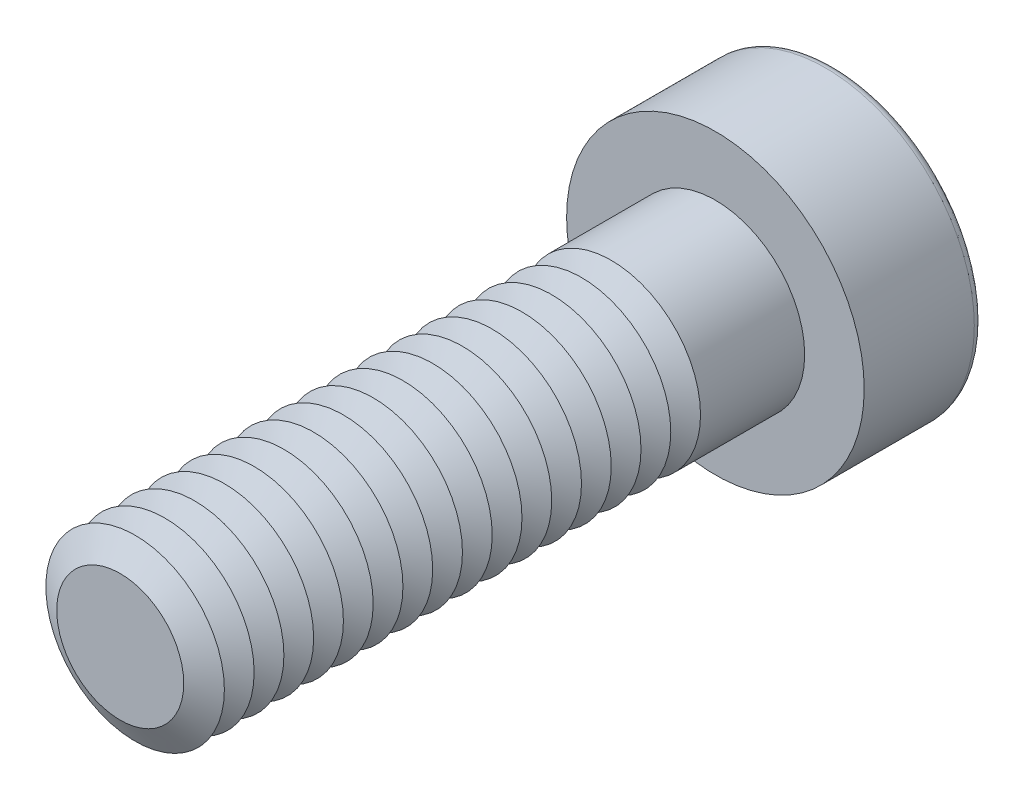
ISO-10303-21;
HEADER;
FILE_DESCRIPTION(('STEP AP214'),'2;1');
FILE_NAME('part.step','',(''),(''),'','','');
FILE_SCHEMA(('AUTOMOTIVE_DESIGN { 1 0 10303 214 1 1 1 1 }'));
ENDSEC;
DATA;
#1=APPLICATION_CONTEXT('core data for automotive mechanical design processes');
#2=APPLICATION_PROTOCOL_DEFINITION('international standard','automotive_design',2000,#1);
#3=PRODUCT_CONTEXT('',#1,'mechanical');
#4=PRODUCT('Part','Part','',(#3));
#5=PRODUCT_RELATED_PRODUCT_CATEGORY('part','',(#4));
#6=PRODUCT_DEFINITION_FORMATION('','',#4);
#7=PRODUCT_DEFINITION_CONTEXT('part definition',#1,'design');
#8=PRODUCT_DEFINITION('design','',#6,#7);
#9=PRODUCT_DEFINITION_SHAPE('','',#8);
#10=(LENGTH_UNIT() NAMED_UNIT(*) SI_UNIT(.MILLI.,.METRE.));
#11=(NAMED_UNIT(*) PLANE_ANGLE_UNIT() SI_UNIT($,.RADIAN.));
#12=(NAMED_UNIT(*) SI_UNIT($,.STERADIAN.) SOLID_ANGLE_UNIT());
#13=UNCERTAINTY_MEASURE_WITH_UNIT(LENGTH_MEASURE(1.E-05),#10,'distance_accuracy_value','');
#14=(GEOMETRIC_REPRESENTATION_CONTEXT(3) GLOBAL_UNCERTAINTY_ASSIGNED_CONTEXT((#13)) GLOBAL_UNIT_ASSIGNED_CONTEXT((#10,
#11,#12)) REPRESENTATION_CONTEXT('',''));
#15=CARTESIAN_POINT('',(0.,0.,0.));
#16=DIRECTION('',(0.,0.,1.));
#17=DIRECTION('',(1.,0.,0.));
#18=AXIS2_PLACEMENT_3D('',#15,#16,#17);
#19=CARTESIAN_POINT('',(0.,0.,16.5));
#20=DIRECTION('',(0.,0.,1.));
#21=DIRECTION('',(1.,0.,0.));
#22=AXIS2_PLACEMENT_3D('',#19,#20,#21);
#23=CONICAL_SURFACE('',#22,3.,1.0471975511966);
#24=CARTESIAN_POINT('',(0.,0.,16.));
#25=DIRECTION('',(0.,0.,1.));
#26=DIRECTION('',(1.,0.,0.));
#27=AXIS2_PLACEMENT_3D('',#24,#25,#26);
#28=CIRCLE('',#27,2.13397459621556);
#29=CARTESIAN_POINT('',(2.13397459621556,0.,16.));
#30=VERTEX_POINT('',#29);
#31=EDGE_CURVE('E313',#30,#30,#28,.T.);
#32=ORIENTED_EDGE('',*,*,#31,.T.);
#33=EDGE_LOOP('',(#32));
#34=FACE_BOUND('',#33,.T.);
#35=CARTESIAN_POINT('',(0.,0.,16.5));
#36=DIRECTION('',(0.,0.,1.));
#37=DIRECTION('',(1.,0.,0.));
#38=AXIS2_PLACEMENT_3D('',#35,#36,#37);
#39=CIRCLE('',#38,3.);
#40=CARTESIAN_POINT('',(3.,0.,16.5));
#41=VERTEX_POINT('',#40);
#42=EDGE_CURVE('E316',#41,#41,#39,.T.);
#43=ORIENTED_EDGE('',*,*,#42,.F.);
#44=EDGE_LOOP('',(#43));
#45=FACE_BOUND('',#44,.T.);
#46=ADVANCED_FACE('F39',(#34,#45),#23,.T.);
#47=CARTESIAN_POINT('',(0.,0.,16.));
#48=DIRECTION('',(0.,0.,-1.));
#49=DIRECTION('',(-1.,0.,0.));
#50=AXIS2_PLACEMENT_3D('',#47,#48,#49);
#51=CONICAL_SURFACE('',#50,2.13397459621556,1.0471975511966);
#52=CARTESIAN_POINT('',(0.,0.,15.5));
#53=DIRECTION('',(0.,0.,1.));
#54=DIRECTION('',(1.,0.,0.));
#55=AXIS2_PLACEMENT_3D('',#52,#53,#54);
#56=CIRCLE('',#55,3.);
#57=CARTESIAN_POINT('',(3.,0.,15.5));
#58=VERTEX_POINT('',#57);
#59=EDGE_CURVE('E323',#58,#58,#56,.T.);
#60=ORIENTED_EDGE('',*,*,#59,.T.);
#61=EDGE_LOOP('',(#60));
#62=FACE_BOUND('',#61,.T.);
#63=ORIENTED_EDGE('',*,*,#31,.F.);
#64=EDGE_LOOP('',(#63));
#65=FACE_BOUND('',#64,.T.);
#66=ADVANCED_FACE('F244',(#62,#65),#51,.T.);
#67=CARTESIAN_POINT('',(0.,0.,20.));
#68=DIRECTION('',(0.,0.,1.));
#69=DIRECTION('',(1.,0.,0.));
#70=AXIS2_PLACEMENT_3D('',#67,#68,#69);
#71=PLANE('',#70);
#72=CARTESIAN_POINT('',(0.,0.,20.));
#73=DIRECTION('',(0.,0.,1.));
#74=DIRECTION('',(1.,0.,0.));
#75=AXIS2_PLACEMENT_3D('',#72,#73,#74);
#76=CIRCLE('',#75,2.13397459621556);
#77=CARTESIAN_POINT('',(2.13397459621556,0.,20.));
#78=VERTEX_POINT('',#77);
#79=EDGE_CURVE('E173',#78,#78,#76,.T.);
#80=ORIENTED_EDGE('',*,*,#79,.T.);
#81=EDGE_LOOP('',(#80));
#82=FACE_BOUND('',#81,.T.);
#83=ADVANCED_FACE('F250',(#82),#71,.T.);
#84=CARTESIAN_POINT('',(0.,0.,20.));
#85=DIRECTION('',(0.,0.,-1.));
#86=DIRECTION('',(-1.,0.,0.));
#87=AXIS2_PLACEMENT_3D('',#84,#85,#86);
#88=CONICAL_SURFACE('',#87,2.13397459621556,1.0471975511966);
#89=CARTESIAN_POINT('',(0.,0.,19.5));
#90=DIRECTION('',(0.,0.,1.));
#91=DIRECTION('',(1.,0.,0.));
#92=AXIS2_PLACEMENT_3D('',#89,#90,#91);
#93=CIRCLE('',#92,3.);
#94=CARTESIAN_POINT('',(3.,0.,19.5));
#95=VERTEX_POINT('',#94);
#96=EDGE_CURVE('E290',#95,#95,#93,.T.);
#97=ORIENTED_EDGE('',*,*,#96,.T.);
#98=EDGE_LOOP('',(#97));
#99=FACE_BOUND('',#98,.T.);
#100=ORIENTED_EDGE('',*,*,#79,.F.);
#101=EDGE_LOOP('',(#100));
#102=FACE_BOUND('',#101,.T.);
#103=ADVANCED_FACE('F198',(#99,#102),#88,.T.);
#104=CARTESIAN_POINT('',(0.,0.,19.5));
#105=DIRECTION('',(0.,0.,1.));
#106=DIRECTION('',(1.,0.,0.));
#107=AXIS2_PLACEMENT_3D('',#104,#105,#106);
#108=CONICAL_SURFACE('',#107,3.,1.0471975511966);
#109=CARTESIAN_POINT('',(0.,0.,19.));
#110=DIRECTION('',(0.,0.,1.));
#111=DIRECTION('',(1.,0.,0.));
#112=AXIS2_PLACEMENT_3D('',#109,#110,#111);
#113=CIRCLE('',#112,2.13397459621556);
#114=CARTESIAN_POINT('',(2.13397459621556,0.,19.));
#115=VERTEX_POINT('',#114);
#116=EDGE_CURVE('E287',#115,#115,#113,.T.);
#117=ORIENTED_EDGE('',*,*,#116,.T.);
#118=EDGE_LOOP('',(#117));
#119=FACE_BOUND('',#118,.T.);
#120=ORIENTED_EDGE('',*,*,#96,.F.);
#121=EDGE_LOOP('',(#120));
#122=FACE_BOUND('',#121,.T.);
#123=ADVANCED_FACE('F276',(#119,#122),#108,.T.);
#124=CARTESIAN_POINT('',(0.,0.,19.));
#125=DIRECTION('',(0.,0.,-1.));
#126=DIRECTION('',(-1.,0.,0.));
#127=AXIS2_PLACEMENT_3D('',#124,#125,#126);
#128=CONICAL_SURFACE('',#127,2.13397459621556,1.0471975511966);
#129=CARTESIAN_POINT('',(0.,0.,18.5));
#130=DIRECTION('',(0.,0.,1.));
#131=DIRECTION('',(1.,0.,0.));
#132=AXIS2_PLACEMENT_3D('',#129,#130,#131);
#133=CIRCLE('',#132,3.);
#134=CARTESIAN_POINT('',(3.,0.,18.5));
#135=VERTEX_POINT('',#134);
#136=EDGE_CURVE('E299',#135,#135,#133,.T.);
#137=ORIENTED_EDGE('',*,*,#136,.T.);
#138=EDGE_LOOP('',(#137));
#139=FACE_BOUND('',#138,.T.);
#140=ORIENTED_EDGE('',*,*,#116,.F.);
#141=EDGE_LOOP('',(#140));
#142=FACE_BOUND('',#141,.T.);
#143=ADVANCED_FACE('F273',(#139,#142),#128,.T.);
#144=CARTESIAN_POINT('',(0.,0.,18.5));
#145=DIRECTION('',(0.,0.,1.));
#146=DIRECTION('',(1.,0.,0.));
#147=AXIS2_PLACEMENT_3D('',#144,#145,#146);
#148=CONICAL_SURFACE('',#147,3.,1.0471975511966);
#149=CARTESIAN_POINT('',(0.,0.,18.));
#150=DIRECTION('',(0.,0.,1.));
#151=DIRECTION('',(1.,0.,0.));
#152=AXIS2_PLACEMENT_3D('',#149,#150,#151);
#153=CIRCLE('',#152,2.13397459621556);
#154=CARTESIAN_POINT('',(2.13397459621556,0.,18.));
#155=VERTEX_POINT('',#154);
#156=EDGE_CURVE('E292',#155,#155,#153,.T.);
#157=ORIENTED_EDGE('',*,*,#156,.T.);
#158=EDGE_LOOP('',(#157));
#159=FACE_BOUND('',#158,.T.);
#160=ORIENTED_EDGE('',*,*,#136,.F.);
#161=EDGE_LOOP('',(#160));
#162=FACE_BOUND('',#161,.T.);
#163=ADVANCED_FACE('F269',(#159,#162),#148,.T.);
#164=CARTESIAN_POINT('',(0.,0.,18.));
#165=DIRECTION('',(0.,0.,-1.));
#166=DIRECTION('',(-1.,0.,0.));
#167=AXIS2_PLACEMENT_3D('',#164,#165,#166);
#168=CONICAL_SURFACE('',#167,2.13397459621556,1.0471975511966);
#169=CARTESIAN_POINT('',(0.,0.,17.5));
#170=DIRECTION('',(0.,0.,1.));
#171=DIRECTION('',(1.,0.,0.));
#172=AXIS2_PLACEMENT_3D('',#169,#170,#171);
#173=CIRCLE('',#172,3.);
#174=CARTESIAN_POINT('',(3.,0.,17.5));
#175=VERTEX_POINT('',#174);
#176=EDGE_CURVE('E309',#175,#175,#173,.T.);
#177=ORIENTED_EDGE('',*,*,#176,.T.);
#178=EDGE_LOOP('',(#177));
#179=FACE_BOUND('',#178,.T.);
#180=ORIENTED_EDGE('',*,*,#156,.F.);
#181=EDGE_LOOP('',(#180));
#182=FACE_BOUND('',#181,.T.);
#183=ADVANCED_FACE('F265',(#179,#182),#168,.T.);
#184=CARTESIAN_POINT('',(0.,0.,17.5));
#185=DIRECTION('',(0.,0.,1.));
#186=DIRECTION('',(1.,0.,0.));
#187=AXIS2_PLACEMENT_3D('',#184,#185,#186);
#188=CONICAL_SURFACE('',#187,3.,1.0471975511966);
#189=CARTESIAN_POINT('',(0.,0.,17.));
#190=DIRECTION('',(0.,0.,1.));
#191=DIRECTION('',(1.,0.,0.));
#192=AXIS2_PLACEMENT_3D('',#189,#190,#191);
#193=CIRCLE('',#192,2.13397459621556);
#194=CARTESIAN_POINT('',(2.13397459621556,0.,17.));
#195=VERTEX_POINT('',#194);
#196=EDGE_CURVE('E305',#195,#195,#193,.T.);
#197=ORIENTED_EDGE('',*,*,#196,.T.);
#198=EDGE_LOOP('',(#197));
#199=FACE_BOUND('',#198,.T.);
#200=ORIENTED_EDGE('',*,*,#176,.F.);
#201=EDGE_LOOP('',(#200));
#202=FACE_BOUND('',#201,.T.);
#203=ADVANCED_FACE('F261',(#199,#202),#188,.T.);
#204=CARTESIAN_POINT('',(0.,0.,17.));
#205=DIRECTION('',(0.,0.,-1.));
#206=DIRECTION('',(-1.,0.,0.));
#207=AXIS2_PLACEMENT_3D('',#204,#205,#206);
#208=CONICAL_SURFACE('',#207,2.13397459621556,1.0471975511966);
#209=ORIENTED_EDGE('',*,*,#42,.T.);
#210=EDGE_LOOP('',(#209));
#211=FACE_BOUND('',#210,.T.);
#212=ORIENTED_EDGE('',*,*,#196,.F.);
#213=EDGE_LOOP('',(#212));
#214=FACE_BOUND('',#213,.T.);
#215=ADVANCED_FACE('F257',(#211,#214),#208,.T.);
#216=CARTESIAN_POINT('',(0.,0.,15.5));
#217=DIRECTION('',(0.,0.,1.));
#218=DIRECTION('',(1.,0.,0.));
#219=AXIS2_PLACEMENT_3D('',#216,#217,#218);
#220=CONICAL_SURFACE('',#219,3.,1.0471975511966);
#221=CARTESIAN_POINT('',(0.,0.,15.));
#222=DIRECTION('',(0.,0.,1.));
#223=DIRECTION('',(1.,0.,0.));
#224=AXIS2_PLACEMENT_3D('',#221,#222,#223);
#225=CIRCLE('',#224,2.13397459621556);
#226=CARTESIAN_POINT('',(2.13397459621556,0.,15.));
#227=VERTEX_POINT('',#226);
#228=EDGE_CURVE('E319',#227,#227,#225,.T.);
#229=ORIENTED_EDGE('',*,*,#228,.T.);
#230=EDGE_LOOP('',(#229));
#231=FACE_BOUND('',#230,.T.);
#232=ORIENTED_EDGE('',*,*,#59,.F.);
#233=EDGE_LOOP('',(#232));
#234=FACE_BOUND('',#233,.T.);
#235=ADVANCED_FACE('F260',(#231,#234),#220,.T.);
#236=CARTESIAN_POINT('',(0.,0.,15.));
#237=DIRECTION('',(0.,0.,-1.));
#238=DIRECTION('',(-1.,0.,0.));
#239=AXIS2_PLACEMENT_3D('',#236,#237,#238);
#240=CONICAL_SURFACE('',#239,2.13397459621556,1.0471975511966);
#241=CARTESIAN_POINT('',(0.,0.,14.5));
#242=DIRECTION('',(0.,0.,1.));
#243=DIRECTION('',(1.,0.,0.));
#244=AXIS2_PLACEMENT_3D('',#241,#242,#243);
#245=CIRCLE('',#244,3.);
#246=CARTESIAN_POINT('',(3.,0.,14.5));
#247=VERTEX_POINT('',#246);
#248=EDGE_CURVE('E331',#247,#247,#245,.T.);
#249=ORIENTED_EDGE('',*,*,#248,.T.);
#250=EDGE_LOOP('',(#249));
#251=FACE_BOUND('',#250,.T.);
#252=ORIENTED_EDGE('',*,*,#228,.F.);
#253=EDGE_LOOP('',(#252));
#254=FACE_BOUND('',#253,.T.);
#255=ADVANCED_FACE('F510',(#251,#254),#240,.T.);
#256=CARTESIAN_POINT('',(0.,0.,14.5));
#257=DIRECTION('',(0.,0.,1.));
#258=DIRECTION('',(1.,0.,0.));
#259=AXIS2_PLACEMENT_3D('',#256,#257,#258);
#260=CONICAL_SURFACE('',#259,3.,1.0471975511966);
#261=CARTESIAN_POINT('',(0.,0.,14.));
#262=DIRECTION('',(0.,0.,1.));
#263=DIRECTION('',(1.,0.,0.));
#264=AXIS2_PLACEMENT_3D('',#261,#262,#263);
#265=CIRCLE('',#264,2.13397459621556);
#266=CARTESIAN_POINT('',(2.13397459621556,0.,14.));
#267=VERTEX_POINT('',#266);
#268=EDGE_CURVE('E327',#267,#267,#265,.T.);
#269=ORIENTED_EDGE('',*,*,#268,.T.);
#270=EDGE_LOOP('',(#269));
#271=FACE_BOUND('',#270,.T.);
#272=ORIENTED_EDGE('',*,*,#248,.F.);
#273=EDGE_LOOP('',(#272));
#274=FACE_BOUND('',#273,.T.);
#275=ADVANCED_FACE('F506',(#271,#274),#260,.T.);
#276=CARTESIAN_POINT('',(0.,0.,14.));
#277=DIRECTION('',(0.,0.,-1.));
#278=DIRECTION('',(-1.,0.,0.));
#279=AXIS2_PLACEMENT_3D('',#276,#277,#278);
#280=CONICAL_SURFACE('',#279,2.13397459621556,1.0471975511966);
#281=CARTESIAN_POINT('',(0.,0.,13.5));
#282=DIRECTION('',(0.,0.,1.));
#283=DIRECTION('',(1.,0.,0.));
#284=AXIS2_PLACEMENT_3D('',#281,#282,#283);
#285=CIRCLE('',#284,3.);
#286=CARTESIAN_POINT('',(3.,0.,13.5));
#287=VERTEX_POINT('',#286);
#288=EDGE_CURVE('E338',#287,#287,#285,.T.);
#289=ORIENTED_EDGE('',*,*,#288,.T.);
#290=EDGE_LOOP('',(#289));
#291=FACE_BOUND('',#290,.T.);
#292=ORIENTED_EDGE('',*,*,#268,.F.);
#293=EDGE_LOOP('',(#292));
#294=FACE_BOUND('',#293,.T.);
#295=ADVANCED_FACE('F502',(#291,#294),#280,.T.);
#296=CARTESIAN_POINT('',(0.,0.,13.5));
#297=DIRECTION('',(0.,0.,1.));
#298=DIRECTION('',(1.,0.,0.));
#299=AXIS2_PLACEMENT_3D('',#296,#297,#298);
#300=CONICAL_SURFACE('',#299,3.,1.0471975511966);
#301=CARTESIAN_POINT('',(0.,0.,13.));
#302=DIRECTION('',(0.,0.,1.));
#303=DIRECTION('',(1.,0.,0.));
#304=AXIS2_PLACEMENT_3D('',#301,#302,#303);
#305=CIRCLE('',#304,2.13397459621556);
#306=CARTESIAN_POINT('',(2.13397459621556,0.,13.));
#307=VERTEX_POINT('',#306);
#308=EDGE_CURVE('E335',#307,#307,#305,.T.);
#309=ORIENTED_EDGE('',*,*,#308,.T.);
#310=EDGE_LOOP('',(#309));
#311=FACE_BOUND('',#310,.T.);
#312=ORIENTED_EDGE('',*,*,#288,.F.);
#313=EDGE_LOOP('',(#312));
#314=FACE_BOUND('',#313,.T.);
#315=ADVANCED_FACE('F498',(#311,#314),#300,.T.);
#316=CARTESIAN_POINT('',(0.,0.,13.));
#317=DIRECTION('',(0.,0.,-1.));
#318=DIRECTION('',(-1.,0.,0.));
#319=AXIS2_PLACEMENT_3D('',#316,#317,#318);
#320=CONICAL_SURFACE('',#319,2.13397459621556,1.0471975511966);
#321=CARTESIAN_POINT('',(0.,0.,12.5));
#322=DIRECTION('',(0.,0.,1.));
#323=DIRECTION('',(1.,0.,0.));
#324=AXIS2_PLACEMENT_3D('',#321,#322,#323);
#325=CIRCLE('',#324,3.);
#326=CARTESIAN_POINT('',(3.,0.,12.5));
#327=VERTEX_POINT('',#326);
#328=EDGE_CURVE('E346',#327,#327,#325,.T.);
#329=ORIENTED_EDGE('',*,*,#328,.T.);
#330=EDGE_LOOP('',(#329));
#331=FACE_BOUND('',#330,.T.);
#332=ORIENTED_EDGE('',*,*,#308,.F.);
#333=EDGE_LOOP('',(#332));
#334=FACE_BOUND('',#333,.T.);
#335=ADVANCED_FACE('F494',(#331,#334),#320,.T.);
#336=CARTESIAN_POINT('',(0.,0.,12.5));
#337=DIRECTION('',(0.,0.,1.));
#338=DIRECTION('',(1.,0.,0.));
#339=AXIS2_PLACEMENT_3D('',#336,#337,#338);
#340=CONICAL_SURFACE('',#339,3.,1.0471975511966);
#341=CARTESIAN_POINT('',(0.,0.,12.));
#342=DIRECTION('',(0.,0.,1.));
#343=DIRECTION('',(1.,0.,0.));
#344=AXIS2_PLACEMENT_3D('',#341,#342,#343);
#345=CIRCLE('',#344,2.13397459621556);
#346=CARTESIAN_POINT('',(2.13397459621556,0.,12.));
#347=VERTEX_POINT('',#346);
#348=EDGE_CURVE('E342',#347,#347,#345,.T.);
#349=ORIENTED_EDGE('',*,*,#348,.T.);
#350=EDGE_LOOP('',(#349));
#351=FACE_BOUND('',#350,.T.);
#352=ORIENTED_EDGE('',*,*,#328,.F.);
#353=EDGE_LOOP('',(#352));
#354=FACE_BOUND('',#353,.T.);
#355=ADVANCED_FACE('F490',(#351,#354),#340,.T.);
#356=CARTESIAN_POINT('',(0.,0.,12.));
#357=DIRECTION('',(0.,0.,-1.));
#358=DIRECTION('',(-1.,0.,0.));
#359=AXIS2_PLACEMENT_3D('',#356,#357,#358);
#360=CONICAL_SURFACE('',#359,2.13397459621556,1.0471975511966);
#361=CARTESIAN_POINT('',(0.,0.,11.5));
#362=DIRECTION('',(0.,0.,1.));
#363=DIRECTION('',(1.,0.,0.));
#364=AXIS2_PLACEMENT_3D('',#361,#362,#363);
#365=CIRCLE('',#364,3.);
#366=CARTESIAN_POINT('',(3.,0.,11.5));
#367=VERTEX_POINT('',#366);
#368=EDGE_CURVE('E354',#367,#367,#365,.T.);
#369=ORIENTED_EDGE('',*,*,#368,.T.);
#370=EDGE_LOOP('',(#369));
#371=FACE_BOUND('',#370,.T.);
#372=ORIENTED_EDGE('',*,*,#348,.F.);
#373=EDGE_LOOP('',(#372));
#374=FACE_BOUND('',#373,.T.);
#375=ADVANCED_FACE('F486',(#371,#374),#360,.T.);
#376=CARTESIAN_POINT('',(0.,0.,11.5));
#377=DIRECTION('',(0.,0.,1.));
#378=DIRECTION('',(1.,0.,0.));
#379=AXIS2_PLACEMENT_3D('',#376,#377,#378);
#380=CONICAL_SURFACE('',#379,3.,1.0471975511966);
#381=CARTESIAN_POINT('',(0.,0.,11.));
#382=DIRECTION('',(0.,0.,1.));
#383=DIRECTION('',(1.,0.,0.));
#384=AXIS2_PLACEMENT_3D('',#381,#382,#383);
#385=CIRCLE('',#384,2.13397459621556);
#386=CARTESIAN_POINT('',(2.13397459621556,0.,11.));
#387=VERTEX_POINT('',#386);
#388=EDGE_CURVE('E350',#387,#387,#385,.T.);
#389=ORIENTED_EDGE('',*,*,#388,.T.);
#390=EDGE_LOOP('',(#389));
#391=FACE_BOUND('',#390,.T.);
#392=ORIENTED_EDGE('',*,*,#368,.F.);
#393=EDGE_LOOP('',(#392));
#394=FACE_BOUND('',#393,.T.);
#395=ADVANCED_FACE('F482',(#391,#394),#380,.T.);
#396=CARTESIAN_POINT('',(0.,0.,11.));
#397=DIRECTION('',(0.,0.,-1.));
#398=DIRECTION('',(-1.,0.,0.));
#399=AXIS2_PLACEMENT_3D('',#396,#397,#398);
#400=CONICAL_SURFACE('',#399,2.13397459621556,1.0471975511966);
#401=CARTESIAN_POINT('',(0.,0.,10.5));
#402=DIRECTION('',(0.,0.,1.));
#403=DIRECTION('',(1.,0.,0.));
#404=AXIS2_PLACEMENT_3D('',#401,#402,#403);
#405=CIRCLE('',#404,3.);
#406=CARTESIAN_POINT('',(3.,0.,10.5));
#407=VERTEX_POINT('',#406);
#408=EDGE_CURVE('E361',#407,#407,#405,.T.);
#409=ORIENTED_EDGE('',*,*,#408,.T.);
#410=EDGE_LOOP('',(#409));
#411=FACE_BOUND('',#410,.T.);
#412=ORIENTED_EDGE('',*,*,#388,.F.);
#413=EDGE_LOOP('',(#412));
#414=FACE_BOUND('',#413,.T.);
#415=ADVANCED_FACE('F478',(#411,#414),#400,.T.);
#416=CARTESIAN_POINT('',(0.,0.,10.5));
#417=DIRECTION('',(0.,0.,1.));
#418=DIRECTION('',(1.,0.,0.));
#419=AXIS2_PLACEMENT_3D('',#416,#417,#418);
#420=CONICAL_SURFACE('',#419,3.,1.0471975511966);
#421=CARTESIAN_POINT('',(0.,0.,10.));
#422=DIRECTION('',(0.,0.,1.));
#423=DIRECTION('',(1.,0.,0.));
#424=AXIS2_PLACEMENT_3D('',#421,#422,#423);
#425=CIRCLE('',#424,2.13397459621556);
#426=CARTESIAN_POINT('',(2.13397459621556,0.,10.));
#427=VERTEX_POINT('',#426);
#428=EDGE_CURVE('E358',#427,#427,#425,.T.);
#429=ORIENTED_EDGE('',*,*,#428,.T.);
#430=EDGE_LOOP('',(#429));
#431=FACE_BOUND('',#430,.T.);
#432=ORIENTED_EDGE('',*,*,#408,.F.);
#433=EDGE_LOOP('',(#432));
#434=FACE_BOUND('',#433,.T.);
#435=ADVANCED_FACE('F474',(#431,#434),#420,.T.);
#436=CARTESIAN_POINT('',(0.,0.,10.));
#437=DIRECTION('',(0.,0.,-1.));
#438=DIRECTION('',(-1.,0.,0.));
#439=AXIS2_PLACEMENT_3D('',#436,#437,#438);
#440=CONICAL_SURFACE('',#439,2.13397459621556,1.0471975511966);
#441=CARTESIAN_POINT('',(0.,0.,9.5));
#442=DIRECTION('',(0.,0.,1.));
#443=DIRECTION('',(1.,0.,0.));
#444=AXIS2_PLACEMENT_3D('',#441,#442,#443);
#445=CIRCLE('',#444,3.);
#446=CARTESIAN_POINT('',(3.,0.,9.5));
#447=VERTEX_POINT('',#446);
#448=EDGE_CURVE('E369',#447,#447,#445,.T.);
#449=ORIENTED_EDGE('',*,*,#448,.T.);
#450=EDGE_LOOP('',(#449));
#451=FACE_BOUND('',#450,.T.);
#452=ORIENTED_EDGE('',*,*,#428,.F.);
#453=EDGE_LOOP('',(#452));
#454=FACE_BOUND('',#453,.T.);
#455=ADVANCED_FACE('F470',(#451,#454),#440,.T.);
#456=CARTESIAN_POINT('',(0.,0.,9.5));
#457=DIRECTION('',(0.,0.,1.));
#458=DIRECTION('',(1.,0.,0.));
#459=AXIS2_PLACEMENT_3D('',#456,#457,#458);
#460=CONICAL_SURFACE('',#459,3.,1.0471975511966);
#461=CARTESIAN_POINT('',(0.,0.,9.));
#462=DIRECTION('',(0.,0.,1.));
#463=DIRECTION('',(1.,0.,0.));
#464=AXIS2_PLACEMENT_3D('',#461,#462,#463);
#465=CIRCLE('',#464,2.13397459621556);
#466=CARTESIAN_POINT('',(2.13397459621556,0.,9.));
#467=VERTEX_POINT('',#466);
#468=EDGE_CURVE('E365',#467,#467,#465,.T.);
#469=ORIENTED_EDGE('',*,*,#468,.T.);
#470=EDGE_LOOP('',(#469));
#471=FACE_BOUND('',#470,.T.);
#472=ORIENTED_EDGE('',*,*,#448,.F.);
#473=EDGE_LOOP('',(#472));
#474=FACE_BOUND('',#473,.T.);
#475=ADVANCED_FACE('F466',(#471,#474),#460,.T.);
#476=CARTESIAN_POINT('',(0.,0.,9.));
#477=DIRECTION('',(0.,0.,-1.));
#478=DIRECTION('',(-1.,0.,0.));
#479=AXIS2_PLACEMENT_3D('',#476,#477,#478);
#480=CONICAL_SURFACE('',#479,2.13397459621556,1.0471975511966);
#481=CARTESIAN_POINT('',(0.,0.,8.5));
#482=DIRECTION('',(0.,0.,1.));
#483=DIRECTION('',(1.,0.,0.));
#484=AXIS2_PLACEMENT_3D('',#481,#482,#483);
#485=CIRCLE('',#484,3.);
#486=CARTESIAN_POINT('',(3.,0.,8.5));
#487=VERTEX_POINT('',#486);
#488=EDGE_CURVE('E377',#487,#487,#485,.T.);
#489=ORIENTED_EDGE('',*,*,#488,.T.);
#490=EDGE_LOOP('',(#489));
#491=FACE_BOUND('',#490,.T.);
#492=ORIENTED_EDGE('',*,*,#468,.F.);
#493=EDGE_LOOP('',(#492));
#494=FACE_BOUND('',#493,.T.);
#495=ADVANCED_FACE('F462',(#491,#494),#480,.T.);
#496=CARTESIAN_POINT('',(0.,0.,8.5));
#497=DIRECTION('',(0.,0.,1.));
#498=DIRECTION('',(1.,0.,0.));
#499=AXIS2_PLACEMENT_3D('',#496,#497,#498);
#500=CONICAL_SURFACE('',#499,3.,1.0471975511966);
#501=CARTESIAN_POINT('',(0.,0.,8.));
#502=DIRECTION('',(0.,0.,1.));
#503=DIRECTION('',(1.,0.,0.));
#504=AXIS2_PLACEMENT_3D('',#501,#502,#503);
#505=CIRCLE('',#504,2.13397459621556);
#506=CARTESIAN_POINT('',(2.13397459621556,0.,8.));
#507=VERTEX_POINT('',#506);
#508=EDGE_CURVE('E373',#507,#507,#505,.T.);
#509=ORIENTED_EDGE('',*,*,#508,.T.);
#510=EDGE_LOOP('',(#509));
#511=FACE_BOUND('',#510,.T.);
#512=ORIENTED_EDGE('',*,*,#488,.F.);
#513=EDGE_LOOP('',(#512));
#514=FACE_BOUND('',#513,.T.);
#515=ADVANCED_FACE('F458',(#511,#514),#500,.T.);
#516=CARTESIAN_POINT('',(0.,0.,8.));
#517=DIRECTION('',(0.,0.,-1.));
#518=DIRECTION('',(-1.,0.,0.));
#519=AXIS2_PLACEMENT_3D('',#516,#517,#518);
#520=CONICAL_SURFACE('',#519,2.13397459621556,1.0471975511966);
#521=CARTESIAN_POINT('',(0.,0.,7.5));
#522=DIRECTION('',(0.,0.,1.));
#523=DIRECTION('',(1.,0.,0.));
#524=AXIS2_PLACEMENT_3D('',#521,#522,#523);
#525=CIRCLE('',#524,3.);
#526=CARTESIAN_POINT('',(3.,0.,7.5));
#527=VERTEX_POINT('',#526);
#528=EDGE_CURVE('E385',#527,#527,#525,.T.);
#529=ORIENTED_EDGE('',*,*,#528,.T.);
#530=EDGE_LOOP('',(#529));
#531=FACE_BOUND('',#530,.T.);
#532=ORIENTED_EDGE('',*,*,#508,.F.);
#533=EDGE_LOOP('',(#532));
#534=FACE_BOUND('',#533,.T.);
#535=ADVANCED_FACE('F454',(#531,#534),#520,.T.);
#536=CARTESIAN_POINT('',(0.,0.,7.5));
#537=DIRECTION('',(0.,0.,1.));
#538=DIRECTION('',(1.,0.,0.));
#539=AXIS2_PLACEMENT_3D('',#536,#537,#538);
#540=CONICAL_SURFACE('',#539,3.,1.0471975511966);
#541=CARTESIAN_POINT('',(0.,0.,7.));
#542=DIRECTION('',(0.,0.,1.));
#543=DIRECTION('',(1.,0.,0.));
#544=AXIS2_PLACEMENT_3D('',#541,#542,#543);
#545=CIRCLE('',#544,2.13397459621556);
#546=CARTESIAN_POINT('',(2.13397459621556,0.,7.));
#547=VERTEX_POINT('',#546);
#548=EDGE_CURVE('E381',#547,#547,#545,.T.);
#549=ORIENTED_EDGE('',*,*,#548,.T.);
#550=EDGE_LOOP('',(#549));
#551=FACE_BOUND('',#550,.T.);
#552=ORIENTED_EDGE('',*,*,#528,.F.);
#553=EDGE_LOOP('',(#552));
#554=FACE_BOUND('',#553,.T.);
#555=ADVANCED_FACE('F450',(#551,#554),#540,.T.);
#556=CARTESIAN_POINT('',(0.,0.,7.));
#557=DIRECTION('',(0.,0.,-1.));
#558=DIRECTION('',(-1.,0.,0.));
#559=AXIS2_PLACEMENT_3D('',#556,#557,#558);
#560=CONICAL_SURFACE('',#559,2.13397459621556,1.0471975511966);
#561=CARTESIAN_POINT('',(0.,0.,6.5));
#562=DIRECTION('',(0.,0.,1.));
#563=DIRECTION('',(1.,0.,0.));
#564=AXIS2_PLACEMENT_3D('',#561,#562,#563);
#565=CIRCLE('',#564,3.);
#566=CARTESIAN_POINT('',(3.,0.,6.5));
#567=VERTEX_POINT('',#566);
#568=EDGE_CURVE('E393',#567,#567,#565,.T.);
#569=ORIENTED_EDGE('',*,*,#568,.T.);
#570=EDGE_LOOP('',(#569));
#571=FACE_BOUND('',#570,.T.);
#572=ORIENTED_EDGE('',*,*,#548,.F.);
#573=EDGE_LOOP('',(#572));
#574=FACE_BOUND('',#573,.T.);
#575=ADVANCED_FACE('F446',(#571,#574),#560,.T.);
#576=CARTESIAN_POINT('',(0.,0.,6.5));
#577=DIRECTION('',(0.,0.,1.));
#578=DIRECTION('',(1.,0.,0.));
#579=AXIS2_PLACEMENT_3D('',#576,#577,#578);
#580=CONICAL_SURFACE('',#579,3.,1.0471975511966);
#581=CARTESIAN_POINT('',(0.,0.,6.));
#582=DIRECTION('',(0.,0.,1.));
#583=DIRECTION('',(1.,0.,0.));
#584=AXIS2_PLACEMENT_3D('',#581,#582,#583);
#585=CIRCLE('',#584,2.13397459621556);
#586=CARTESIAN_POINT('',(2.13397459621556,0.,6.));
#587=VERTEX_POINT('',#586);
#588=EDGE_CURVE('E389',#587,#587,#585,.T.);
#589=ORIENTED_EDGE('',*,*,#588,.T.);
#590=EDGE_LOOP('',(#589));
#591=FACE_BOUND('',#590,.T.);
#592=ORIENTED_EDGE('',*,*,#568,.F.);
#593=EDGE_LOOP('',(#592));
#594=FACE_BOUND('',#593,.T.);
#595=ADVANCED_FACE('F442',(#591,#594),#580,.T.);
#596=CARTESIAN_POINT('',(0.,0.,6.));
#597=DIRECTION('',(0.,0.,-1.));
#598=DIRECTION('',(-1.,0.,0.));
#599=AXIS2_PLACEMENT_3D('',#596,#597,#598);
#600=CONICAL_SURFACE('',#599,2.13397459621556,1.0471975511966);
#601=CARTESIAN_POINT('',(0.,0.,5.5));
#602=DIRECTION('',(0.,0.,1.));
#603=DIRECTION('',(1.,0.,0.));
#604=AXIS2_PLACEMENT_3D('',#601,#602,#603);
#605=CIRCLE('',#604,3.);
#606=CARTESIAN_POINT('',(3.,0.,5.5));
#607=VERTEX_POINT('',#606);
#608=EDGE_CURVE('E401',#607,#607,#605,.T.);
#609=ORIENTED_EDGE('',*,*,#608,.T.);
#610=EDGE_LOOP('',(#609));
#611=FACE_BOUND('',#610,.T.);
#612=ORIENTED_EDGE('',*,*,#588,.F.);
#613=EDGE_LOOP('',(#612));
#614=FACE_BOUND('',#613,.T.);
#615=ADVANCED_FACE('F438',(#611,#614),#600,.T.);
#616=CARTESIAN_POINT('',(0.,0.,5.5));
#617=DIRECTION('',(0.,0.,1.));
#618=DIRECTION('',(1.,0.,0.));
#619=AXIS2_PLACEMENT_3D('',#616,#617,#618);
#620=CONICAL_SURFACE('',#619,3.,1.0471975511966);
#621=CARTESIAN_POINT('',(0.,0.,5.));
#622=DIRECTION('',(0.,0.,1.));
#623=DIRECTION('',(1.,0.,0.));
#624=AXIS2_PLACEMENT_3D('',#621,#622,#623);
#625=CIRCLE('',#624,2.13397459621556);
#626=CARTESIAN_POINT('',(2.13397459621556,0.,5.));
#627=VERTEX_POINT('',#626);
#628=EDGE_CURVE('E397',#627,#627,#625,.T.);
#629=ORIENTED_EDGE('',*,*,#628,.T.);
#630=EDGE_LOOP('',(#629));
#631=FACE_BOUND('',#630,.T.);
#632=ORIENTED_EDGE('',*,*,#608,.F.);
#633=EDGE_LOOP('',(#632));
#634=FACE_BOUND('',#633,.T.);
#635=ADVANCED_FACE('F433',(#631,#634),#620,.T.);
#636=CARTESIAN_POINT('',(0.,0.,5.));
#637=DIRECTION('',(0.,0.,-1.));
#638=DIRECTION('',(-1.,0.,0.));
#639=AXIS2_PLACEMENT_3D('',#636,#637,#638);
#640=CONICAL_SURFACE('',#639,2.13397459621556,1.0471975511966);
#641=CARTESIAN_POINT('',(0.,0.,4.5));
#642=DIRECTION('',(0.,0.,1.));
#643=DIRECTION('',(1.,0.,0.));
#644=AXIS2_PLACEMENT_3D('',#641,#642,#643);
#645=CIRCLE('',#644,3.);
#646=CARTESIAN_POINT('',(3.,0.,4.5));
#647=VERTEX_POINT('',#646);
#648=EDGE_CURVE('E413',#647,#647,#645,.T.);
#649=ORIENTED_EDGE('',*,*,#648,.T.);
#650=EDGE_LOOP('',(#649));
#651=FACE_BOUND('',#650,.T.);
#652=ORIENTED_EDGE('',*,*,#628,.F.);
#653=EDGE_LOOP('',(#652));
#654=FACE_BOUND('',#653,.T.);
#655=ADVANCED_FACE('F419',(#651,#654),#640,.T.);
#656=CARTESIAN_POINT('',(0.,0.,4.5));
#657=DIRECTION('',(0.,0.,1.));
#658=DIRECTION('',(1.,0.,0.));
#659=AXIS2_PLACEMENT_3D('',#656,#657,#658);
#660=CONICAL_SURFACE('',#659,3.,1.0471975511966);
#661=CARTESIAN_POINT('',(0.,0.,4.));
#662=DIRECTION('',(0.,0.,1.));
#663=DIRECTION('',(1.,0.,0.));
#664=AXIS2_PLACEMENT_3D('',#661,#662,#663);
#665=CIRCLE('',#664,2.13397459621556);
#666=CARTESIAN_POINT('',(2.13397459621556,0.,4.));
#667=VERTEX_POINT('',#666);
#668=EDGE_CURVE('E405',#667,#667,#665,.T.);
#669=ORIENTED_EDGE('',*,*,#668,.T.);
#670=EDGE_LOOP('',(#669));
#671=FACE_BOUND('',#670,.T.);
#672=ORIENTED_EDGE('',*,*,#648,.F.);
#673=EDGE_LOOP('',(#672));
#674=FACE_BOUND('',#673,.T.);
#675=ADVANCED_FACE('F422',(#671,#674),#660,.T.);
#676=CARTESIAN_POINT('',(0.,0.,4.));
#677=DIRECTION('',(0.,0.,-1.));
#678=DIRECTION('',(-1.,0.,0.));
#679=AXIS2_PLACEMENT_3D('',#676,#677,#678);
#680=CONICAL_SURFACE('',#679,2.13397459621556,1.0471975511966);
#681=CARTESIAN_POINT('',(0.,0.,3.5));
#682=DIRECTION('',(0.,0.,1.));
#683=DIRECTION('',(1.,0.,0.));
#684=AXIS2_PLACEMENT_3D('',#681,#682,#683);
#685=CIRCLE('',#684,3.);
#686=CARTESIAN_POINT('',(3.,0.,3.5));
#687=VERTEX_POINT('',#686);
#688=EDGE_CURVE('E409',#687,#687,#685,.T.);
#689=ORIENTED_EDGE('',*,*,#688,.T.);
#690=EDGE_LOOP('',(#689));
#691=FACE_BOUND('',#690,.T.);
#692=ORIENTED_EDGE('',*,*,#668,.F.);
#693=EDGE_LOOP('',(#692));
#694=FACE_BOUND('',#693,.T.);
#695=ADVANCED_FACE('F424',(#691,#694),#680,.T.);
#696=CARTESIAN_POINT('',(0.,0.,-1.));
#697=DIRECTION('',(0.,0.,-1.));
#698=DIRECTION('',(-1.,0.,0.));
#699=AXIS2_PLACEMENT_3D('',#696,#697,#698);
#700=CONICAL_SURFACE('',#699,2.,1.0471975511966);
#701=CARTESIAN_POINT('',(0.,0.,0.154700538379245));
#702=VERTEX_POINT('',#701);
#703=VERTEX_LOOP('',#702);
#704=FACE_BOUND('',#703,.T.);
#705=CARTESIAN_POINT('',(0.,0.,-1.));
#706=DIRECTION('',(0.,0.,-1.));
#707=DIRECTION('',(-1.,0.,0.));
#708=AXIS2_PLACEMENT_3D('',#705,#706,#707);
#709=CIRCLE('',#708,2.);
#710=CARTESIAN_POINT('',(-1.73205080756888,0.999999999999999,-1.));
#711=VERTEX_POINT('',#710);
#712=CARTESIAN_POINT('',(0.,2.,-1.));
#713=VERTEX_POINT('',#712);
#714=EDGE_CURVE('E149',#711,#713,#709,.T.);
#715=ORIENTED_EDGE('',*,*,#714,.T.);
#716=CARTESIAN_POINT('',(0.,0.,-1.));
#717=DIRECTION('',(0.,0.,-1.));
#718=DIRECTION('',(-1.,0.,0.));
#719=AXIS2_PLACEMENT_3D('',#716,#717,#718);
#720=CIRCLE('',#719,2.);
#721=CARTESIAN_POINT('',(1.73205080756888,1.,-1.));
#722=VERTEX_POINT('',#721);
#723=EDGE_CURVE('E54',#713,#722,#720,.T.);
#724=ORIENTED_EDGE('',*,*,#723,.T.);
#725=CARTESIAN_POINT('',(1.73205080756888,-0.999999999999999,-1.));
#726=VERTEX_POINT('',#725);
#727=EDGE_CURVE('E1025',#722,#726,#720,.T.);
#728=ORIENTED_EDGE('',*,*,#727,.T.);
#729=CARTESIAN_POINT('',(0.,-2.,-1.));
#730=VERTEX_POINT('',#729);
#731=EDGE_CURVE('E1023',#726,#730,#720,.T.);
#732=ORIENTED_EDGE('',*,*,#731,.T.);
#733=CARTESIAN_POINT('',(-1.73205080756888,-0.999999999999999,-1.));
#734=VERTEX_POINT('',#733);
#735=EDGE_CURVE('E1018',#730,#734,#720,.T.);
#736=ORIENTED_EDGE('',*,*,#735,.T.);
#737=EDGE_CURVE('E1016',#734,#711,#720,.T.);
#738=ORIENTED_EDGE('',*,*,#737,.T.);
#739=EDGE_LOOP('',(#715,#724,#728,#732,#736,#738));
#740=FACE_BOUND('',#739,.T.);
#741=ADVANCED_FACE('F200',(#704,#740),#700,.F.);
#742=CARTESIAN_POINT('',(0.,0.,-1.));
#743=DIRECTION('',(0.,0.,-1.));
#744=DIRECTION('',(-1.,0.,0.));
#745=AXIS2_PLACEMENT_3D('',#742,#743,#744);
#746=PLANE('',#745);
#747=ORIENTED_EDGE('',*,*,#723,.F.);
#748=DIRECTION('',(1.,0.,0.));
#749=VECTOR('',#748,1.);
#750=CARTESIAN_POINT('',(-1.15470053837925,2.,-1.));
#751=LINE('',#750,#749);
#752=CARTESIAN_POINT('',(1.15470053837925,2.,-1.));
#753=VERTEX_POINT('',#752);
#754=EDGE_CURVE('E1065',#713,#753,#751,.T.);
#755=ORIENTED_EDGE('',*,*,#754,.T.);
#756=DIRECTION('',(0.5,-0.866025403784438,0.));
#757=VECTOR('',#756,1.);
#758=CARTESIAN_POINT('',(1.15470053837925,2.,-1.));
#759=LINE('',#758,#757);
#760=EDGE_CURVE('E155',#753,#722,#759,.T.);
#761=ORIENTED_EDGE('',*,*,#760,.T.);
#762=EDGE_LOOP('',(#747,#755,#761));
#763=FACE_BOUND('',#762,.T.);
#764=ADVANCED_FACE('F605',(#763),#746,.T.);
#765=ORIENTED_EDGE('',*,*,#727,.F.);
#766=CARTESIAN_POINT('',(2.3094010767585,0.,-1.));
#767=VERTEX_POINT('',#766);
#768=EDGE_CURVE('E1067',#722,#767,#759,.T.);
#769=ORIENTED_EDGE('',*,*,#768,.T.);
#770=DIRECTION('',(-0.5,-0.866025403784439,0.));
#771=VECTOR('',#770,1.);
#772=CARTESIAN_POINT('',(2.3094010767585,0.,-1.));
#773=LINE('',#772,#771);
#774=EDGE_CURVE('E1039',#767,#726,#773,.T.);
#775=ORIENTED_EDGE('',*,*,#774,.T.);
#776=EDGE_LOOP('',(#765,#769,#775));
#777=FACE_BOUND('',#776,.T.);
#778=ADVANCED_FACE('F615',(#777),#746,.T.);
#779=ORIENTED_EDGE('',*,*,#731,.F.);
#780=CARTESIAN_POINT('',(1.15470053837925,-2.,-1.));
#781=VERTEX_POINT('',#780);
#782=EDGE_CURVE('E1041',#726,#781,#773,.T.);
#783=ORIENTED_EDGE('',*,*,#782,.T.);
#784=DIRECTION('',(-1.,0.,0.));
#785=VECTOR('',#784,1.);
#786=CARTESIAN_POINT('',(1.15470053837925,-2.,-1.));
#787=LINE('',#786,#785);
#788=EDGE_CURVE('E990',#781,#730,#787,.T.);
#789=ORIENTED_EDGE('',*,*,#788,.T.);
#790=EDGE_LOOP('',(#779,#783,#789));
#791=FACE_BOUND('',#790,.T.);
#792=ADVANCED_FACE('F625',(#791),#746,.T.);
#793=ORIENTED_EDGE('',*,*,#735,.F.);
#794=CARTESIAN_POINT('',(-1.15470053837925,-2.,-1.));
#795=VERTEX_POINT('',#794);
#796=EDGE_CURVE('E1035',#730,#795,#787,.T.);
#797=ORIENTED_EDGE('',*,*,#796,.T.);
#798=DIRECTION('',(-0.5,0.866025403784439,0.));
#799=VECTOR('',#798,1.);
#800=CARTESIAN_POINT('',(-1.15470053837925,-2.,-1.));
#801=LINE('',#800,#799);
#802=EDGE_CURVE('E1037',#795,#734,#801,.T.);
#803=ORIENTED_EDGE('',*,*,#802,.T.);
#804=EDGE_LOOP('',(#793,#797,#803));
#805=FACE_BOUND('',#804,.T.);
#806=ADVANCED_FACE('F633',(#805),#746,.T.);
#807=ORIENTED_EDGE('',*,*,#737,.F.);
#808=CARTESIAN_POINT('',(-2.3094010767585,0.,-1.));
#809=VERTEX_POINT('',#808);
#810=EDGE_CURVE('E1043',#734,#809,#801,.T.);
#811=ORIENTED_EDGE('',*,*,#810,.T.);
#812=DIRECTION('',(0.5,0.866025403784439,0.));
#813=VECTOR('',#812,1.);
#814=CARTESIAN_POINT('',(-2.3094010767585,0.,-1.));
#815=LINE('',#814,#813);
#816=EDGE_CURVE('E158',#809,#711,#815,.T.);
#817=ORIENTED_EDGE('',*,*,#816,.T.);
#818=EDGE_LOOP('',(#807,#811,#817));
#819=FACE_BOUND('',#818,.T.);
#820=ADVANCED_FACE('F230',(#819),#746,.T.);
#821=ORIENTED_EDGE('',*,*,#714,.F.);
#822=CARTESIAN_POINT('',(-1.15470053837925,2.,-1.));
#823=VERTEX_POINT('',#822);
#824=EDGE_CURVE('E1050',#711,#823,#815,.T.);
#825=ORIENTED_EDGE('',*,*,#824,.T.);
#826=EDGE_CURVE('E1064',#823,#713,#751,.T.);
#827=ORIENTED_EDGE('',*,*,#826,.T.);
#828=EDGE_LOOP('',(#821,#825,#827));
#829=FACE_BOUND('',#828,.T.);
#830=ADVANCED_FACE('F617',(#829),#746,.T.);
#831=CARTESIAN_POINT('',(-1.15470053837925,2.,-1.));
#832=DIRECTION('',(0.,1.,0.));
#833=DIRECTION('',(0.,0.,1.));
#834=AXIS2_PLACEMENT_3D('',#831,#832,#833);
#835=PLANE('',#834);
#836=DIRECTION('',(0.,0.,-1.));
#837=VECTOR('',#836,1.);
#838=CARTESIAN_POINT('',(-1.15470053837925,2.,-1.));
#839=LINE('',#838,#837);
#840=CARTESIAN_POINT('',(-1.15470053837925,2.,-4.));
#841=VERTEX_POINT('',#840);
#842=EDGE_CURVE('E147',#823,#841,#839,.T.);
#843=ORIENTED_EDGE('',*,*,#842,.T.);
#844=CARTESIAN_POINT('',(-3.01440758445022,2.,-4.35051689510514));
#845=CARTESIAN_POINT('',(-2.92409762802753,2.,-4.33035636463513));
#846=CARTESIAN_POINT('',(-2.83373054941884,2.,-4.31045254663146));
#847=CARTESIAN_POINT('',(-2.65285291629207,2.,-4.27128852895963));
#848=CARTESIAN_POINT('',(-2.562342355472,2.,-4.25202835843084));
#849=CARTESIAN_POINT('',(-2.29037985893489,2.,-4.19537300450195));
#850=CARTESIAN_POINT('',(-2.10868043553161,2.,-4.15914446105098));
#851=CARTESIAN_POINT('',(-1.74597297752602,2.,-4.09171688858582));
#852=CARTESIAN_POINT('',(-1.56497266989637,2.,-4.06047686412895));
#853=CARTESIAN_POINT('',(-1.20186568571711,2.,-4.00513826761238));
#854=CARTESIAN_POINT('',(-1.01975924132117,2.,-3.98103824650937));
#855=CARTESIAN_POINT('',(-0.744747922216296,2.,-3.9525901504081));
#856=CARTESIAN_POINT('',(-0.652245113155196,2.,-3.9443671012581));
#857=CARTESIAN_POINT('',(-0.467020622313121,2.,-3.93099406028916));
#858=CARTESIAN_POINT('',(-0.374298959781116,2.,-3.92584380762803));
#859=CARTESIAN_POINT('',(-0.188764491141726,2.,-3.91891540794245));
#860=CARTESIAN_POINT('',(-0.0959517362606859,2.,-3.91713591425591));
#861=CARTESIAN_POINT('',(0.0896753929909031,2.,-3.91705786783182));
#862=CARTESIAN_POINT('',(0.182489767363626,2.,-3.91875932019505));
#863=CARTESIAN_POINT('',(0.368369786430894,2.,-3.92554892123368));
#864=CARTESIAN_POINT('',(0.461434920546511,2.,-3.93065079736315));
#865=CARTESIAN_POINT('',(0.647346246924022,2.,-3.94395663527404));
#866=CARTESIAN_POINT('',(0.740192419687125,2.,-3.95216086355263));
#867=CARTESIAN_POINT('',(1.01841374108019,2.,-3.98081777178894));
#868=CARTESIAN_POINT('',(1.2033713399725,2.,-4.00531018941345));
#869=CARTESIAN_POINT('',(1.57694396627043,2.,-4.06236202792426));
#870=CARTESIAN_POINT('',(1.76552771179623,2.,-4.09511615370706));
#871=CARTESIAN_POINT('',(2.14178491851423,2.,-4.1655706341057));
#872=CARTESIAN_POINT('',(2.32945822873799,2.,-4.20327178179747));
#873=CARTESIAN_POINT('',(2.70417911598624,2.,-4.28188312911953));
#874=CARTESIAN_POINT('',(2.89122649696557,2.,-4.32279425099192));
#875=CARTESIAN_POINT('',(3.26484478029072,2.,-4.40674298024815));
#876=CARTESIAN_POINT('',(3.45141567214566,2.,-4.44978063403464));
#877=CARTESIAN_POINT('',(3.821938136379,2.,-4.53678178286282));
#878=CARTESIAN_POINT('',(4.00589388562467,2.,-4.58072756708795));
#879=CARTESIAN_POINT('',(4.37356350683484,2.,-4.66963526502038));
#880=CARTESIAN_POINT('',(4.55727737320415,2.,-4.71459720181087));
#881=CARTESIAN_POINT('',(4.9242660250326,2.,-4.80519833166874));
#882=CARTESIAN_POINT('',(5.10754106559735,2.,-4.85083649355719));
#883=CARTESIAN_POINT('',(5.47394280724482,2.,-4.94267693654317));
#884=CARTESIAN_POINT('',(5.65706951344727,2.,-4.98887919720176));
#885=CARTESIAN_POINT('',(5.84014583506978,2.,-5.03527803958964));
#886=B_SPLINE_CURVE_WITH_KNOTS('',3,(#844,#845,#846,#847,#848,#849,#850,#851,#852,#853,#854,
#855,#856,#857,#858,#859,#860,#861,#862,#863,#864,#865,#866,#867,#868,#869,#870,#871,#872,#873,
#874,#875,#876,#877,#878,#879,#880,#881,#882,#883,#884,#885),.UNSPECIFIED.,.F.,.F.,(4,2,2,2,2,2,
2,2,2,2,2,2,2,2,2,2,2,2,2,2,4),(0.,0.277597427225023,0.555207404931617,1.11099118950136,
1.66194208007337,2.21278108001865,2.49134108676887,2.76987744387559,3.04830249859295,
3.32672796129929,3.60628428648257,3.88586463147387,4.44532615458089,5.0194589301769,
5.59368385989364,6.16807437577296,6.74247743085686,7.30986991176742,7.87727529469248,
8.44388991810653,9.01048407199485),.UNSPECIFIED.);
#887=CARTESIAN_POINT('',(1.15470053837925,2.,-4.));
#888=VERTEX_POINT('',#887);
#889=EDGE_CURVE('E124',#841,#888,#886,.T.);
#890=ORIENTED_EDGE('',*,*,#889,.T.);
#891=DIRECTION('',(0.,0.,-1.));
#892=VECTOR('',#891,1.);
#893=CARTESIAN_POINT('',(1.15470053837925,2.,-1.));
#894=LINE('',#893,#892);
#895=EDGE_CURVE('E143',#753,#888,#894,.T.);
#896=ORIENTED_EDGE('',*,*,#895,.F.);
#897=ORIENTED_EDGE('',*,*,#754,.F.);
#898=ORIENTED_EDGE('',*,*,#826,.F.);
#899=EDGE_LOOP('',(#843,#890,#896,#897,#898));
#900=FACE_BOUND('',#899,.T.);
#901=ADVANCED_FACE('F141',(#900),#835,.F.);
#902=CARTESIAN_POINT('',(1.15470053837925,2.,-1.));
#903=DIRECTION('',(0.866025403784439,0.5,0.));
#904=DIRECTION('',(-0.5,0.866025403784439,0.));
#905=AXIS2_PLACEMENT_3D('',#902,#903,#904);
#906=PLANE('',#905);
#907=ORIENTED_EDGE('',*,*,#895,.T.);
#908=CARTESIAN_POINT('',(1.15458506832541,2.0002,-4.00003094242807));
#909=CARTESIAN_POINT('',(1.20254643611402,1.91712847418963,-3.98717294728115));
#910=CARTESIAN_POINT('',(1.25059477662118,1.83390630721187,-3.97549990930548));
#911=CARTESIAN_POINT('',(1.3468611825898,1.66716800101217,-3.95499135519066));
#912=CARTESIAN_POINT('',(1.39507930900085,1.58365175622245,-3.94615699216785));
#913=CARTESIAN_POINT('',(1.49139287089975,1.41683177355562,-3.93184164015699));
#914=CARTESIAN_POINT('',(1.53948765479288,1.33352916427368,-3.92634357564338));
#915=CARTESIAN_POINT('',(1.63573857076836,1.1668176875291,-3.91897122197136));
#916=CARTESIAN_POINT('',(1.68389468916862,1.08340884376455,-3.91709623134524));
#917=CARTESIAN_POINT('',(1.78020692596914,0.916591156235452,-3.91709623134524));
#918=CARTESIAN_POINT('',(1.82836304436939,0.833182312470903,-3.91897122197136));
#919=CARTESIAN_POINT('',(1.92461396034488,0.666470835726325,-3.92634357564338));
#920=CARTESIAN_POINT('',(1.972708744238,0.583168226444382,-3.93184164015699));
#921=CARTESIAN_POINT('',(2.06902230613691,0.416348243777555,-3.94615699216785));
#922=CARTESIAN_POINT('',(2.11724043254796,0.332831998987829,-3.95499135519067));
#923=CARTESIAN_POINT('',(2.21350683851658,0.16609369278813,-3.97549990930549));
#924=CARTESIAN_POINT('',(2.26155517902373,0.0828715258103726,-3.98717294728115));
#925=CARTESIAN_POINT('',(2.30951654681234,-0.000199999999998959,-4.00003094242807));
#926=B_SPLINE_CURVE_WITH_KNOTS('',3,(#908,#909,#910,#911,#912,#913,#914,#915,#916,#917,#918,
#919,#920,#921,#922,#923,#924,#925),.UNSPECIFIED.,.F.,.F.,(4,2,2,2,2,2,2,2,4),(0.,
0.29035724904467,0.580832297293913,0.869807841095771,1.15872743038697,1.44764701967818,
1.73662256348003,2.02709761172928,2.31745486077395),.UNSPECIFIED.);
#927=CARTESIAN_POINT('',(2.3094010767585,0.,-4.));
#928=VERTEX_POINT('',#927);
#929=EDGE_CURVE('E11',#888,#928,#926,.T.);
#930=ORIENTED_EDGE('',*,*,#929,.T.);
#931=DIRECTION('',(0.,0.,-1.));
#932=VECTOR('',#931,1.);
#933=CARTESIAN_POINT('',(2.3094010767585,0.,-1.));
#934=LINE('',#933,#932);
#935=EDGE_CURVE('E157',#767,#928,#934,.T.);
#936=ORIENTED_EDGE('',*,*,#935,.F.);
#937=ORIENTED_EDGE('',*,*,#768,.F.);
#938=ORIENTED_EDGE('',*,*,#760,.F.);
#939=EDGE_LOOP('',(#907,#930,#936,#937,#938));
#940=FACE_BOUND('',#939,.T.);
#941=ADVANCED_FACE('F152',(#940),#906,.F.);
#942=CARTESIAN_POINT('',(2.3094010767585,0.,-1.));
#943=DIRECTION('',(0.866025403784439,-0.5,0.));
#944=DIRECTION('',(0.5,0.866025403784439,0.));
#945=AXIS2_PLACEMENT_3D('',#942,#943,#944);
#946=PLANE('',#945);
#947=ORIENTED_EDGE('',*,*,#935,.T.);
#948=CARTESIAN_POINT('',(2.30951654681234,0.000200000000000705,-4.00003094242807));
#949=CARTESIAN_POINT('',(2.26155517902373,-0.0828715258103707,-3.98717294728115));
#950=CARTESIAN_POINT('',(2.21350683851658,-0.166093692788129,-3.97549990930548));
#951=CARTESIAN_POINT('',(2.11724043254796,-0.332831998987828,-3.95499135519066));
#952=CARTESIAN_POINT('',(2.06902230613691,-0.416348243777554,-3.94615699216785));
#953=CARTESIAN_POINT('',(1.972708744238,-0.583168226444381,-3.93184164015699));
#954=CARTESIAN_POINT('',(1.92461396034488,-0.666470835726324,-3.92634357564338));
#955=CARTESIAN_POINT('',(1.82836304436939,-0.833182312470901,-3.91897122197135));
#956=CARTESIAN_POINT('',(1.78020692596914,-0.91659115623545,-3.91709623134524));
#957=CARTESIAN_POINT('',(1.68389468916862,-1.08340884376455,-3.91709623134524));
#958=CARTESIAN_POINT('',(1.63573857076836,-1.1668176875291,-3.91897122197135));
#959=CARTESIAN_POINT('',(1.53948765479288,-1.33352916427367,-3.92634357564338));
#960=CARTESIAN_POINT('',(1.49139287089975,-1.41683177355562,-3.93184164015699));
#961=CARTESIAN_POINT('',(1.39507930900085,-1.58365175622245,-3.94615699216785));
#962=CARTESIAN_POINT('',(1.3468611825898,-1.66716800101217,-3.95499135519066));
#963=CARTESIAN_POINT('',(1.25059477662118,-1.83390630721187,-3.97549990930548));
#964=CARTESIAN_POINT('',(1.20254643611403,-1.91712847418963,-3.98717294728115));
#965=CARTESIAN_POINT('',(1.15458506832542,-2.0002,-4.00003094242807));
#966=B_SPLINE_CURVE_WITH_KNOTS('',3,(#948,#949,#950,#951,#952,#953,#954,#955,#956,#957,#958,
#959,#960,#961,#962,#963,#964,#965),.UNSPECIFIED.,.F.,.F.,(4,2,2,2,2,2,2,2,4),(0.,
0.290357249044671,0.580832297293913,0.869807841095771,1.15872743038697,1.44764701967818,
1.73662256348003,2.02709761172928,2.31745486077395),.UNSPECIFIED.);
#967=CARTESIAN_POINT('',(1.15470053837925,-2.,-4.));
#968=VERTEX_POINT('',#967);
#969=EDGE_CURVE('E172',#928,#968,#966,.T.);
#970=ORIENTED_EDGE('',*,*,#969,.T.);
#971=DIRECTION('',(0.,0.,-1.));
#972=VECTOR('',#971,1.);
#973=CARTESIAN_POINT('',(1.15470053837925,-2.,-1.));
#974=LINE('',#973,#972);
#975=EDGE_CURVE('E985',#781,#968,#974,.T.);
#976=ORIENTED_EDGE('',*,*,#975,.F.);
#977=ORIENTED_EDGE('',*,*,#782,.F.);
#978=ORIENTED_EDGE('',*,*,#774,.F.);
#979=EDGE_LOOP('',(#947,#970,#976,#977,#978));
#980=FACE_BOUND('',#979,.T.);
#981=ADVANCED_FACE('F190',(#980),#946,.F.);
#982=CARTESIAN_POINT('',(1.15470053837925,-2.,-1.));
#983=DIRECTION('',(0.,-1.,0.));
#984=DIRECTION('',(0.,0.,-1.));
#985=AXIS2_PLACEMENT_3D('',#982,#983,#984);
#986=PLANE('',#985);
#987=ORIENTED_EDGE('',*,*,#975,.T.);
#988=CARTESIAN_POINT('',(-3.01440758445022,-2.,-4.35051689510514));
#989=CARTESIAN_POINT('',(-2.92409762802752,-2.,-4.33035636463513));
#990=CARTESIAN_POINT('',(-2.83373054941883,-2.,-4.31045254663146));
#991=CARTESIAN_POINT('',(-2.65285291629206,-2.,-4.27128852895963));
#992=CARTESIAN_POINT('',(-2.562342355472,-2.,-4.25202835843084));
#993=CARTESIAN_POINT('',(-2.29037985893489,-2.,-4.19537300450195));
#994=CARTESIAN_POINT('',(-2.10868043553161,-2.,-4.15914446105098));
#995=CARTESIAN_POINT('',(-1.74597297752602,-2.,-4.09171688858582));
#996=CARTESIAN_POINT('',(-1.56497266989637,-2.,-4.06047686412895));
#997=CARTESIAN_POINT('',(-1.20186568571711,-2.,-4.00513826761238));
#998=CARTESIAN_POINT('',(-1.01975924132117,-2.,-3.98103824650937));
#999=CARTESIAN_POINT('',(-0.744747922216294,-2.,-3.9525901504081));
#1000=CARTESIAN_POINT('',(-0.652245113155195,-2.,-3.9443671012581));
#1001=CARTESIAN_POINT('',(-0.46702062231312,-2.,-3.93099406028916));
#1002=CARTESIAN_POINT('',(-0.374298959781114,-2.,-3.92584380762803));
#1003=CARTESIAN_POINT('',(-0.188764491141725,-2.,-3.91891540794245));
#1004=CARTESIAN_POINT('',(-0.0959517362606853,-2.,-3.91713591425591));
#1005=CARTESIAN_POINT('',(0.0896753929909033,-2.,-3.91705786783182));
#1006=CARTESIAN_POINT('',(0.182489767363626,-2.,-3.91875932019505));
#1007=CARTESIAN_POINT('',(0.368369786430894,-2.,-3.92554892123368));
#1008=CARTESIAN_POINT('',(0.461434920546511,-2.,-3.93065079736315));
#1009=CARTESIAN_POINT('',(0.647346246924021,-2.,-3.94395663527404));
#1010=CARTESIAN_POINT('',(0.740192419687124,-2.,-3.95216086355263));
#1011=CARTESIAN_POINT('',(1.01841374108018,-2.,-3.98081777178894));
#1012=CARTESIAN_POINT('',(1.2033713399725,-2.,-4.00531018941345));
#1013=CARTESIAN_POINT('',(1.57694396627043,-2.,-4.06236202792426));
#1014=CARTESIAN_POINT('',(1.76552771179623,-2.,-4.09511615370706));
#1015=CARTESIAN_POINT('',(2.14178491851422,-2.,-4.1655706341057));
#1016=CARTESIAN_POINT('',(2.32945822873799,-2.,-4.20327178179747));
#1017=CARTESIAN_POINT('',(2.70417911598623,-2.,-4.28188312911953));
#1018=CARTESIAN_POINT('',(2.89122649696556,-2.,-4.32279425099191));
#1019=CARTESIAN_POINT('',(3.26484478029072,-2.,-4.40674298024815));
#1020=CARTESIAN_POINT('',(3.45141567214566,-2.,-4.44978063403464));
#1021=CARTESIAN_POINT('',(3.821938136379,-2.,-4.53678178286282));
#1022=CARTESIAN_POINT('',(4.00589388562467,-2.,-4.58072756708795));
#1023=CARTESIAN_POINT('',(4.37356350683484,-2.,-4.66963526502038));
#1024=CARTESIAN_POINT('',(4.55727737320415,-2.,-4.71459720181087));
#1025=CARTESIAN_POINT('',(4.9242660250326,-2.,-4.80519833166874));
#1026=CARTESIAN_POINT('',(5.10754106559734,-2.,-4.85083649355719));
#1027=CARTESIAN_POINT('',(5.47394280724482,-2.,-4.94267693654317));
#1028=CARTESIAN_POINT('',(5.65706951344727,-2.,-4.98887919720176));
#1029=CARTESIAN_POINT('',(5.84014583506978,-2.,-5.03527803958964));
#1030=B_SPLINE_CURVE_WITH_KNOTS('',3,(#988,#989,#990,#991,#992,#993,#994,#995,#996,#997,#998,
#999,#1000,#1001,#1002,#1003,#1004,#1005,#1006,#1007,#1008,#1009,#1010,#1011,#1012,#1013,#1014,
#1015,#1016,#1017,#1018,#1019,#1020,#1021,#1022,#1023,#1024,#1025,#1026,#1027,#1028,#1029),
.UNSPECIFIED.,.F.,.F.,(4,2,2,2,2,2,2,2,2,2,2,2,2,2,2,2,2,2,2,2,4),(0.,0.277597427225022,
0.555207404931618,1.11099118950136,1.66194208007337,2.21278108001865,2.49134108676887,
2.76987744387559,3.04830249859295,3.32672796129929,3.60628428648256,3.88586463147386,
4.44532615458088,5.01945893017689,5.59368385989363,6.16807437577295,6.74247743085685,
7.30986991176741,7.87727529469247,8.44388991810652,9.01048407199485),.UNSPECIFIED.);
#1031=CARTESIAN_POINT('',(-1.15470053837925,-2.,-4.));
#1032=VERTEX_POINT('',#1031);
#1033=EDGE_CURVE('E183',#968,#1032,#1030,.F.);
#1034=ORIENTED_EDGE('',*,*,#1033,.T.);
#1035=DIRECTION('',(0.,0.,-1.));
#1036=VECTOR('',#1035,1.);
#1037=CARTESIAN_POINT('',(-1.15470053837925,-2.,-1.));
#1038=LINE('',#1037,#1036);
#1039=EDGE_CURVE('E992',#795,#1032,#1038,.T.);
#1040=ORIENTED_EDGE('',*,*,#1039,.F.);
#1041=ORIENTED_EDGE('',*,*,#796,.F.);
#1042=ORIENTED_EDGE('',*,*,#788,.F.);
#1043=EDGE_LOOP('',(#987,#1034,#1040,#1041,#1042));
#1044=FACE_BOUND('',#1043,.T.);
#1045=ADVANCED_FACE('F233',(#1044),#986,.F.);
#1046=CARTESIAN_POINT('',(-1.15470053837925,-2.,-1.));
#1047=DIRECTION('',(-0.866025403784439,-0.5,0.));
#1048=DIRECTION('',(0.5,-0.866025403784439,0.));
#1049=AXIS2_PLACEMENT_3D('',#1046,#1047,#1048);
#1050=PLANE('',#1049);
#1051=ORIENTED_EDGE('',*,*,#1039,.T.);
#1052=CARTESIAN_POINT('',(-1.15458506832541,-2.0002,-4.00003094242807));
#1053=CARTESIAN_POINT('',(-1.20254643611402,-1.91712847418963,-3.98717294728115));
#1054=CARTESIAN_POINT('',(-1.25059477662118,-1.83390630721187,-3.97549990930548));
#1055=CARTESIAN_POINT('',(-1.34686118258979,-1.66716800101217,-3.95499135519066));
#1056=CARTESIAN_POINT('',(-1.39507930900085,-1.58365175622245,-3.94615699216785));
#1057=CARTESIAN_POINT('',(-1.49139287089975,-1.41683177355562,-3.93184164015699));
#1058=CARTESIAN_POINT('',(-1.53948765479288,-1.33352916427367,-3.92634357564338));
#1059=CARTESIAN_POINT('',(-1.63573857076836,-1.1668176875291,-3.91897122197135));
#1060=CARTESIAN_POINT('',(-1.68389468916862,-1.08340884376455,-3.91709623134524));
#1061=CARTESIAN_POINT('',(-1.78020692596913,-0.91659115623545,-3.91709623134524));
#1062=CARTESIAN_POINT('',(-1.82836304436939,-0.833182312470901,-3.91897122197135));
#1063=CARTESIAN_POINT('',(-1.92461396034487,-0.666470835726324,-3.92634357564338));
#1064=CARTESIAN_POINT('',(-1.972708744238,-0.583168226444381,-3.93184164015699));
#1065=CARTESIAN_POINT('',(-2.0690223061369,-0.416348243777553,-3.94615699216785));
#1066=CARTESIAN_POINT('',(-2.11724043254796,-0.332831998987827,-3.95499135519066));
#1067=CARTESIAN_POINT('',(-2.21350683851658,-0.166093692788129,-3.97549990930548));
#1068=CARTESIAN_POINT('',(-2.26155517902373,-0.0828715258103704,-3.98717294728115));
#1069=CARTESIAN_POINT('',(-2.30951654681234,0.000200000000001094,-4.00003094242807));
#1070=B_SPLINE_CURVE_WITH_KNOTS('',3,(#1052,#1053,#1054,#1055,#1056,#1057,#1058,#1059,#1060,
#1061,#1062,#1063,#1064,#1065,#1066,#1067,#1068,#1069),.UNSPECIFIED.,.F.,.F.,(4,2,2,2,2,2,2,2,
4),(0.,0.290357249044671,0.580832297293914,0.869807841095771,1.15872743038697,1.44764701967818,
1.73662256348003,2.02709761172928,2.31745486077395),.UNSPECIFIED.);
#1071=CARTESIAN_POINT('',(-2.3094010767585,0.,-4.));
#1072=VERTEX_POINT('',#1071);
#1073=EDGE_CURVE('E207',#1032,#1072,#1070,.T.);
#1074=ORIENTED_EDGE('',*,*,#1073,.T.);
#1075=DIRECTION('',(0.,0.,-1.));
#1076=VECTOR('',#1075,1.);
#1077=CARTESIAN_POINT('',(-2.3094010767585,0.,-1.));
#1078=LINE('',#1077,#1076);
#1079=EDGE_CURVE('E997',#809,#1072,#1078,.T.);
#1080=ORIENTED_EDGE('',*,*,#1079,.F.);
#1081=ORIENTED_EDGE('',*,*,#810,.F.);
#1082=ORIENTED_EDGE('',*,*,#802,.F.);
#1083=EDGE_LOOP('',(#1051,#1074,#1080,#1081,#1082));
#1084=FACE_BOUND('',#1083,.T.);
#1085=ADVANCED_FACE('F228',(#1084),#1050,.F.);
#1086=CARTESIAN_POINT('',(-2.3094010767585,0.,-1.));
#1087=DIRECTION('',(-0.866025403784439,0.5,0.));
#1088=DIRECTION('',(-0.5,-0.866025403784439,0.));
#1089=AXIS2_PLACEMENT_3D('',#1086,#1087,#1088);
#1090=PLANE('',#1089);
#1091=ORIENTED_EDGE('',*,*,#1079,.T.);
#1092=CARTESIAN_POINT('',(-2.30951654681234,-0.00019999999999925,-4.00003094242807));
#1093=CARTESIAN_POINT('',(-2.26155517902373,0.0828715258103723,-3.98717294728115));
#1094=CARTESIAN_POINT('',(-2.21350683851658,0.16609369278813,-3.97549990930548));
#1095=CARTESIAN_POINT('',(-2.11724043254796,0.332831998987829,-3.95499135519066));
#1096=CARTESIAN_POINT('',(-2.0690223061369,0.416348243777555,-3.94615699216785));
#1097=CARTESIAN_POINT('',(-1.972708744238,0.583168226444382,-3.93184164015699));
#1098=CARTESIAN_POINT('',(-1.92461396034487,0.666470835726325,-3.92634357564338));
#1099=CARTESIAN_POINT('',(-1.82836304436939,0.833182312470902,-3.91897122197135));
#1100=CARTESIAN_POINT('',(-1.78020692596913,0.916591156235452,-3.91709623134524));
#1101=CARTESIAN_POINT('',(-1.68389468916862,1.08340884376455,-3.91709623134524));
#1102=CARTESIAN_POINT('',(-1.63573857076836,1.1668176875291,-3.91897122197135));
#1103=CARTESIAN_POINT('',(-1.53948765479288,1.33352916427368,-3.92634357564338));
#1104=CARTESIAN_POINT('',(-1.49139287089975,1.41683177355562,-3.93184164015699));
#1105=CARTESIAN_POINT('',(-1.39507930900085,1.58365175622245,-3.94615699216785));
#1106=CARTESIAN_POINT('',(-1.3468611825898,1.66716800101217,-3.95499135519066));
#1107=CARTESIAN_POINT('',(-1.25059477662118,1.83390630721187,-3.97549990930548));
#1108=CARTESIAN_POINT('',(-1.20254643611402,1.91712847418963,-3.98717294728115));
#1109=CARTESIAN_POINT('',(-1.15458506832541,2.0002,-4.00003094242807));
#1110=B_SPLINE_CURVE_WITH_KNOTS('',3,(#1092,#1093,#1094,#1095,#1096,#1097,#1098,#1099,#1100,
#1101,#1102,#1103,#1104,#1105,#1106,#1107,#1108,#1109),.UNSPECIFIED.,.F.,.F.,(4,2,2,2,2,2,2,2,
4),(0.,0.29035724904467,0.580832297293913,0.869807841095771,1.15872743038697,1.44764701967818,
1.73662256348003,2.02709761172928,2.31745486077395),.UNSPECIFIED.);
#1111=EDGE_CURVE('E150',#1072,#841,#1110,.T.);
#1112=ORIENTED_EDGE('',*,*,#1111,.T.);
#1113=ORIENTED_EDGE('',*,*,#842,.F.);
#1114=ORIENTED_EDGE('',*,*,#824,.F.);
#1115=ORIENTED_EDGE('',*,*,#816,.F.);
#1116=EDGE_LOOP('',(#1091,#1112,#1113,#1114,#1115));
#1117=FACE_BOUND('',#1116,.T.);
#1118=ADVANCED_FACE('F196',(#1117),#1090,.F.);
#1119=CARTESIAN_POINT('',(0.,0.,-4.));
#1120=DIRECTION('',(0.,0.,-1.));
#1121=DIRECTION('',(-1.,0.,0.));
#1122=AXIS2_PLACEMENT_3D('',#1119,#1120,#1121);
#1123=CONICAL_SURFACE('',#1122,2.3094010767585,1.30899693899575);
#1124=CARTESIAN_POINT('',(0.,0.,-4.));
#1125=DIRECTION('',(0.,0.,-1.));
#1126=DIRECTION('',(-1.,0.,0.));
#1127=AXIS2_PLACEMENT_3D('',#1124,#1125,#1126);
#1128=CIRCLE('',#1127,2.3094010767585);
#1129=EDGE_CURVE('E120',#841,#888,#1128,.T.);
#1130=ORIENTED_EDGE('',*,*,#1129,.T.);
#1131=ORIENTED_EDGE('',*,*,#889,.F.);
#1132=EDGE_LOOP('',(#1130,#1131));
#1133=FACE_BOUND('',#1132,.T.);
#1134=ADVANCED_FACE('F122',(#1133),#1123,.F.);
#1135=EDGE_CURVE('E129',#888,#928,#1128,.T.);
#1136=ORIENTED_EDGE('',*,*,#1135,.T.);
#1137=ORIENTED_EDGE('',*,*,#929,.F.);
#1138=EDGE_LOOP('',(#1136,#1137));
#1139=FACE_BOUND('',#1138,.T.);
#1140=ADVANCED_FACE('F133',(#1139),#1123,.F.);
#1141=EDGE_CURVE('E164',#928,#968,#1128,.T.);
#1142=ORIENTED_EDGE('',*,*,#1141,.T.);
#1143=ORIENTED_EDGE('',*,*,#969,.F.);
#1144=EDGE_LOOP('',(#1142,#1143));
#1145=FACE_BOUND('',#1144,.T.);
#1146=ADVANCED_FACE('F698',(#1145),#1123,.F.);
#1147=EDGE_CURVE('E168',#968,#1032,#1128,.T.);
#1148=ORIENTED_EDGE('',*,*,#1147,.T.);
#1149=ORIENTED_EDGE('',*,*,#1033,.F.);
#1150=EDGE_LOOP('',(#1148,#1149));
#1151=FACE_BOUND('',#1150,.T.);
#1152=ADVANCED_FACE('F705',(#1151),#1123,.F.);
#1153=EDGE_CURVE('E67',#1032,#1072,#1128,.T.);
#1154=ORIENTED_EDGE('',*,*,#1153,.T.);
#1155=ORIENTED_EDGE('',*,*,#1073,.F.);
#1156=EDGE_LOOP('',(#1154,#1155));
#1157=FACE_BOUND('',#1156,.T.);
#1158=ADVANCED_FACE('F713',(#1157),#1123,.F.);
#1159=EDGE_CURVE('E60',#1072,#841,#1128,.T.);
#1160=ORIENTED_EDGE('',*,*,#1159,.T.);
#1161=ORIENTED_EDGE('',*,*,#1111,.F.);
#1162=EDGE_LOOP('',(#1160,#1161));
#1163=FACE_BOUND('',#1162,.T.);
#1164=ADVANCED_FACE('F197',(#1163),#1123,.F.);
#1165=CARTESIAN_POINT('',(0.,0.,-4.));
#1166=DIRECTION('',(0.,0.,-1.));
#1167=DIRECTION('',(-1.,0.,0.));
#1168=AXIS2_PLACEMENT_3D('',#1165,#1166,#1167);
#1169=PLANE('',#1168);
#1170=ORIENTED_EDGE('',*,*,#1159,.F.);
#1171=ORIENTED_EDGE('',*,*,#1153,.F.);
#1172=ORIENTED_EDGE('',*,*,#1147,.F.);
#1173=ORIENTED_EDGE('',*,*,#1141,.F.);
#1174=ORIENTED_EDGE('',*,*,#1135,.F.);
#1175=ORIENTED_EDGE('',*,*,#1129,.F.);
#1176=EDGE_LOOP('',(#1170,#1171,#1172,#1173,#1174,#1175));
#1177=FACE_BOUND('',#1176,.T.);
#1178=CARTESIAN_POINT('',(0.,0.,-4.));
#1179=DIRECTION('',(0.,0.,-1.));
#1180=DIRECTION('',(-1.,0.,0.));
#1181=AXIS2_PLACEMENT_3D('',#1178,#1179,#1180);
#1182=CIRCLE('',#1181,4.7);
#1183=CARTESIAN_POINT('',(-4.7,0.,-4.));
#1184=VERTEX_POINT('',#1183);
#1185=EDGE_CURVE('E1010',#1184,#1184,#1182,.T.);
#1186=ORIENTED_EDGE('',*,*,#1185,.T.);
#1187=EDGE_LOOP('',(#1186));
#1188=FACE_BOUND('',#1187,.T.);
#1189=ADVANCED_FACE('F161',(#1177,#1188),#1169,.T.);
#1190=CARTESIAN_POINT('',(0.,0.,-3.7));
#1191=DIRECTION('',(0.,0.,-1.));
#1192=DIRECTION('',(-1.,0.,0.));
#1193=AXIS2_PLACEMENT_3D('',#1190,#1191,#1192);
#1194=TOROIDAL_SURFACE('',#1193,4.7,0.3);
#1195=CARTESIAN_POINT('',(0.,0.,-3.7));
#1196=DIRECTION('',(0.,0.,-1.));
#1197=DIRECTION('',(-1.,0.,0.));
#1198=AXIS2_PLACEMENT_3D('',#1195,#1196,#1197);
#1199=CIRCLE('',#1198,5.);
#1200=CARTESIAN_POINT('',(-5.,0.,-3.7));
#1201=VERTEX_POINT('',#1200);
#1202=EDGE_CURVE('E1014',#1201,#1201,#1199,.F.);
#1203=ORIENTED_EDGE('',*,*,#1202,.F.);
#1204=EDGE_LOOP('',(#1203));
#1205=FACE_BOUND('',#1204,.T.);
#1206=ORIENTED_EDGE('',*,*,#1185,.F.);
#1207=EDGE_LOOP('',(#1206));
#1208=FACE_BOUND('',#1207,.T.);
#1209=ADVANCED_FACE('F41',(#1205,#1208),#1194,.T.);
#1210=CARTESIAN_POINT('',(0.,0.,-4.));
#1211=DIRECTION('',(0.,0.,1.));
#1212=DIRECTION('',(1.,0.,0.));
#1213=AXIS2_PLACEMENT_3D('',#1210,#1211,#1212);
#1214=CYLINDRICAL_SURFACE('',#1213,5.);
#1215=ORIENTED_EDGE('',*,*,#1202,.T.);
#1216=EDGE_LOOP('',(#1215));
#1217=FACE_BOUND('',#1216,.T.);
#1218=CARTESIAN_POINT('',(0.,0.,0.));
#1219=DIRECTION('',(0.,0.,-1.));
#1220=DIRECTION('',(-1.,0.,0.));
#1221=AXIS2_PLACEMENT_3D('',#1218,#1219,#1220);
#1222=CIRCLE('',#1221,5.);
#1223=CARTESIAN_POINT('',(-5.,0.,0.));
#1224=VERTEX_POINT('',#1223);
#1225=EDGE_CURVE('E1002',#1224,#1224,#1222,.T.);
#1226=ORIENTED_EDGE('',*,*,#1225,.T.);
#1227=EDGE_LOOP('',(#1226));
#1228=FACE_BOUND('',#1227,.T.);
#1229=ADVANCED_FACE('F737',(#1217,#1228),#1214,.T.);
#1230=CARTESIAN_POINT('',(0.,0.,0.));
#1231=DIRECTION('',(0.,0.,-1.));
#1232=DIRECTION('',(-1.,0.,0.));
#1233=AXIS2_PLACEMENT_3D('',#1230,#1231,#1232);
#1234=PLANE('',#1233);
#1235=CARTESIAN_POINT('',(0.,0.,0.));
#1236=DIRECTION('',(0.,0.,1.));
#1237=DIRECTION('',(1.,0.,0.));
#1238=AXIS2_PLACEMENT_3D('',#1235,#1236,#1237);
#1239=CIRCLE('',#1238,3.);
#1240=CARTESIAN_POINT('',(3.,0.,0.));
#1241=VERTEX_POINT('',#1240);
#1242=EDGE_CURVE('E1006',#1241,#1241,#1239,.T.);
#1243=ORIENTED_EDGE('',*,*,#1242,.F.);
#1244=EDGE_LOOP('',(#1243));
#1245=FACE_BOUND('',#1244,.T.);
#1246=ORIENTED_EDGE('',*,*,#1225,.F.);
#1247=EDGE_LOOP('',(#1246));
#1248=FACE_BOUND('',#1247,.T.);
#1249=ADVANCED_FACE('F745',(#1245,#1248),#1234,.F.);
#1250=CARTESIAN_POINT('',(0.,0.,20.));
#1251=DIRECTION('',(0.,0.,-1.));
#1252=DIRECTION('',(-1.,0.,0.));
#1253=AXIS2_PLACEMENT_3D('',#1250,#1251,#1252);
#1254=CYLINDRICAL_SURFACE('',#1253,3.);
#1255=ORIENTED_EDGE('',*,*,#1242,.T.);
#1256=EDGE_LOOP('',(#1255));
#1257=FACE_BOUND('',#1256,.T.);
#1258=ORIENTED_EDGE('',*,*,#688,.F.);
#1259=EDGE_LOOP('',(#1258));
#1260=FACE_BOUND('',#1259,.T.);
#1261=ADVANCED_FACE('F754',(#1257,#1260),#1254,.T.);
#1262=CLOSED_SHELL('',(#46,#66,#83,#103,#123,#143,#163,#183,#203,#215,#235,#255,#275,#295,#315,
#335,#355,#375,#395,#415,#435,#455,#475,#495,#515,#535,#555,#575,#595,#615,#635,#655,#675,#695,
#741,#764,#778,#792,#806,#820,#830,#901,#941,#981,#1045,#1085,#1118,#1134,#1140,#1146,#1152,
#1158,#1164,#1189,#1209,#1229,#1249,#1261));
#1263=MANIFOLD_SOLID_BREP('B2',#1262);
#1264=ADVANCED_BREP_SHAPE_REPRESENTATION('',(#18,#1263),#14);
#1265=SHAPE_DEFINITION_REPRESENTATION(#9,#1264);
ENDSEC;
END-ISO-10303-21;
